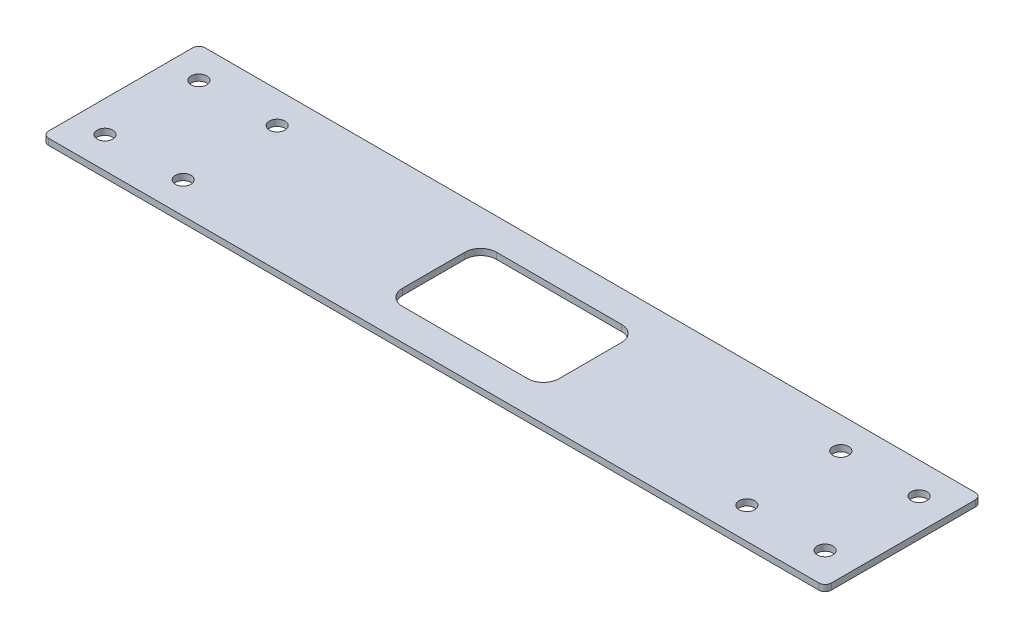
ISO-10303-21;
HEADER;
FILE_DESCRIPTION(('STEP AP214'),'2;1');
FILE_NAME('part.step','',(''),(''),'','','');
FILE_SCHEMA(('AUTOMOTIVE_DESIGN { 1 0 10303 214 1 1 1 1 }'));
ENDSEC;
DATA;
#1=APPLICATION_CONTEXT('core data for automotive mechanical design processes');
#2=APPLICATION_PROTOCOL_DEFINITION('international standard','automotive_design',2000,#1);
#3=PRODUCT_CONTEXT('',#1,'mechanical');
#4=PRODUCT('Part','Part','',(#3));
#5=PRODUCT_RELATED_PRODUCT_CATEGORY('part','',(#4));
#6=PRODUCT_DEFINITION_FORMATION('','',#4);
#7=PRODUCT_DEFINITION_CONTEXT('part definition',#1,'design');
#8=PRODUCT_DEFINITION('design','',#6,#7);
#9=PRODUCT_DEFINITION_SHAPE('','',#8);
#10=(LENGTH_UNIT() NAMED_UNIT(*) SI_UNIT(.MILLI.,.METRE.));
#11=(NAMED_UNIT(*) PLANE_ANGLE_UNIT() SI_UNIT($,.RADIAN.));
#12=(NAMED_UNIT(*) SI_UNIT($,.STERADIAN.) SOLID_ANGLE_UNIT());
#13=UNCERTAINTY_MEASURE_WITH_UNIT(LENGTH_MEASURE(1.E-05),#10,'distance_accuracy_value','');
#14=(GEOMETRIC_REPRESENTATION_CONTEXT(3) GLOBAL_UNCERTAINTY_ASSIGNED_CONTEXT((#13)) GLOBAL_UNIT_ASSIGNED_CONTEXT((#10,
#11,#12)) REPRESENTATION_CONTEXT('',''));
#15=CARTESIAN_POINT('',(0.,0.,0.));
#16=DIRECTION('',(0.,0.,1.));
#17=DIRECTION('',(1.,0.,0.));
#18=AXIS2_PLACEMENT_3D('',#15,#16,#17);
#19=CARTESIAN_POINT('',(-125.,2.,25.));
#20=DIRECTION('',(1.,0.,0.));
#21=DIRECTION('',(0.,0.,-1.));
#22=AXIS2_PLACEMENT_3D('',#19,#20,#21);
#23=PLANE('',#22);
#24=DIRECTION('',(0.,0.,1.));
#25=VECTOR('',#24,1.);
#26=CARTESIAN_POINT('',(-125.,2.,25.));
#27=LINE('',#26,#25);
#28=CARTESIAN_POINT('',(-125.,2.,-23.));
#29=VERTEX_POINT('',#28);
#30=CARTESIAN_POINT('',(-125.,2.,23.));
#31=VERTEX_POINT('',#30);
#32=EDGE_CURVE('E229',#29,#31,#27,.T.);
#33=ORIENTED_EDGE('',*,*,#32,.F.);
#34=DIRECTION('',(0.,-1.,0.));
#35=VECTOR('',#34,1.);
#36=CARTESIAN_POINT('',(-125.,2.,-23.));
#37=LINE('',#36,#35);
#38=CARTESIAN_POINT('',(-125.,0.,-23.));
#39=VERTEX_POINT('',#38);
#40=EDGE_CURVE('E251',#29,#39,#37,.T.);
#41=ORIENTED_EDGE('',*,*,#40,.T.);
#42=DIRECTION('',(0.,0.,1.));
#43=VECTOR('',#42,1.);
#44=CARTESIAN_POINT('',(-125.,0.,25.));
#45=LINE('',#44,#43);
#46=CARTESIAN_POINT('',(-125.,0.,23.));
#47=VERTEX_POINT('',#46);
#48=EDGE_CURVE('E217',#39,#47,#45,.T.);
#49=ORIENTED_EDGE('',*,*,#48,.T.);
#50=DIRECTION('',(0.,-1.,0.));
#51=VECTOR('',#50,1.);
#52=CARTESIAN_POINT('',(-125.,2.,23.));
#53=LINE('',#52,#51);
#54=EDGE_CURVE('E240',#47,#31,#53,.F.);
#55=ORIENTED_EDGE('',*,*,#54,.T.);
#56=EDGE_LOOP('',(#33,#41,#49,#55));
#57=FACE_BOUND('',#56,.T.);
#58=ADVANCED_FACE('F36',(#57),#23,.F.);
#59=CARTESIAN_POINT('',(125.,2.,25.));
#60=DIRECTION('',(0.,0.,-1.));
#61=DIRECTION('',(-1.,0.,0.));
#62=AXIS2_PLACEMENT_3D('',#59,#60,#61);
#63=PLANE('',#62);
#64=DIRECTION('',(1.,0.,0.));
#65=VECTOR('',#64,1.);
#66=CARTESIAN_POINT('',(125.,0.,25.));
#67=LINE('',#66,#65);
#68=CARTESIAN_POINT('',(-123.,0.,25.));
#69=VERTEX_POINT('',#68);
#70=CARTESIAN_POINT('',(123.,0.,25.));
#71=VERTEX_POINT('',#70);
#72=EDGE_CURVE('E243',#69,#71,#67,.T.);
#73=ORIENTED_EDGE('',*,*,#72,.T.);
#74=DIRECTION('',(0.,-1.,0.));
#75=VECTOR('',#74,1.);
#76=CARTESIAN_POINT('',(123.,2.,25.));
#77=LINE('',#76,#75);
#78=CARTESIAN_POINT('',(123.,2.,25.));
#79=VERTEX_POINT('',#78);
#80=EDGE_CURVE('E11',#71,#79,#77,.F.);
#81=ORIENTED_EDGE('',*,*,#80,.T.);
#82=DIRECTION('',(1.,0.,0.));
#83=VECTOR('',#82,1.);
#84=CARTESIAN_POINT('',(125.,2.,25.));
#85=LINE('',#84,#83);
#86=CARTESIAN_POINT('',(-123.,2.,25.));
#87=VERTEX_POINT('',#86);
#88=EDGE_CURVE('E232',#87,#79,#85,.T.);
#89=ORIENTED_EDGE('',*,*,#88,.F.);
#90=DIRECTION('',(0.,-1.,0.));
#91=VECTOR('',#90,1.);
#92=CARTESIAN_POINT('',(-123.,2.,25.));
#93=LINE('',#92,#91);
#94=EDGE_CURVE('E44',#87,#69,#93,.T.);
#95=ORIENTED_EDGE('',*,*,#94,.T.);
#96=EDGE_LOOP('',(#73,#81,#89,#95));
#97=FACE_BOUND('',#96,.T.);
#98=ADVANCED_FACE('F282',(#97),#63,.F.);
#99=CARTESIAN_POINT('',(125.,2.,25.));
#100=DIRECTION('',(-1.,0.,0.));
#101=DIRECTION('',(0.,0.,1.));
#102=AXIS2_PLACEMENT_3D('',#99,#100,#101);
#103=PLANE('',#102);
#104=DIRECTION('',(0.,0.,-1.));
#105=VECTOR('',#104,1.);
#106=CARTESIAN_POINT('',(125.,0.,25.));
#107=LINE('',#106,#105);
#108=CARTESIAN_POINT('',(125.,0.,23.));
#109=VERTEX_POINT('',#108);
#110=CARTESIAN_POINT('',(125.,0.,-23.));
#111=VERTEX_POINT('',#110);
#112=EDGE_CURVE('E246',#109,#111,#107,.T.);
#113=ORIENTED_EDGE('',*,*,#112,.T.);
#114=DIRECTION('',(0.,-1.,0.));
#115=VECTOR('',#114,1.);
#116=CARTESIAN_POINT('',(125.,2.,-23.));
#117=LINE('',#116,#115);
#118=CARTESIAN_POINT('',(125.,2.,-23.));
#119=VERTEX_POINT('',#118);
#120=EDGE_CURVE('E51',#111,#119,#117,.F.);
#121=ORIENTED_EDGE('',*,*,#120,.T.);
#122=DIRECTION('',(0.,0.,-1.));
#123=VECTOR('',#122,1.);
#124=CARTESIAN_POINT('',(125.,2.,25.));
#125=LINE('',#124,#123);
#126=CARTESIAN_POINT('',(125.,2.,23.));
#127=VERTEX_POINT('',#126);
#128=EDGE_CURVE('E235',#127,#119,#125,.T.);
#129=ORIENTED_EDGE('',*,*,#128,.F.);
#130=DIRECTION('',(0.,-1.,0.));
#131=VECTOR('',#130,1.);
#132=CARTESIAN_POINT('',(125.,2.,23.));
#133=LINE('',#132,#131);
#134=EDGE_CURVE('E274',#127,#109,#133,.T.);
#135=ORIENTED_EDGE('',*,*,#134,.T.);
#136=EDGE_LOOP('',(#113,#121,#129,#135));
#137=FACE_BOUND('',#136,.T.);
#138=ADVANCED_FACE('F291',(#137),#103,.F.);
#139=CARTESIAN_POINT('',(125.,2.,-25.));
#140=DIRECTION('',(0.,0.,1.));
#141=DIRECTION('',(1.,0.,0.));
#142=AXIS2_PLACEMENT_3D('',#139,#140,#141);
#143=PLANE('',#142);
#144=DIRECTION('',(-1.,0.,0.));
#145=VECTOR('',#144,1.);
#146=CARTESIAN_POINT('',(125.,0.,-25.));
#147=LINE('',#146,#145);
#148=CARTESIAN_POINT('',(123.,0.,-25.));
#149=VERTEX_POINT('',#148);
#150=CARTESIAN_POINT('',(-123.,0.,-25.));
#151=VERTEX_POINT('',#150);
#152=EDGE_CURVE('E233',#149,#151,#147,.T.);
#153=ORIENTED_EDGE('',*,*,#152,.T.);
#154=DIRECTION('',(0.,-1.,0.));
#155=VECTOR('',#154,1.);
#156=CARTESIAN_POINT('',(-123.,2.,-25.));
#157=LINE('',#156,#155);
#158=CARTESIAN_POINT('',(-123.,2.,-25.));
#159=VERTEX_POINT('',#158);
#160=EDGE_CURVE('E265',#151,#159,#157,.F.);
#161=ORIENTED_EDGE('',*,*,#160,.T.);
#162=DIRECTION('',(-1.,0.,0.));
#163=VECTOR('',#162,1.);
#164=CARTESIAN_POINT('',(125.,2.,-25.));
#165=LINE('',#164,#163);
#166=CARTESIAN_POINT('',(123.,2.,-25.));
#167=VERTEX_POINT('',#166);
#168=EDGE_CURVE('E237',#167,#159,#165,.T.);
#169=ORIENTED_EDGE('',*,*,#168,.F.);
#170=DIRECTION('',(0.,-1.,0.));
#171=VECTOR('',#170,1.);
#172=CARTESIAN_POINT('',(123.,2.,-25.));
#173=LINE('',#172,#171);
#174=EDGE_CURVE('E262',#167,#149,#173,.T.);
#175=ORIENTED_EDGE('',*,*,#174,.T.);
#176=EDGE_LOOP('',(#153,#161,#169,#175));
#177=FACE_BOUND('',#176,.T.);
#178=ADVANCED_FACE('F300',(#177),#143,.F.);
#179=CARTESIAN_POINT('',(0.,2.,0.));
#180=DIRECTION('',(0.,1.,0.));
#181=DIRECTION('',(0.,0.,1.));
#182=AXIS2_PLACEMENT_3D('',#179,#180,#181);
#183=PLANE('',#182);
#184=CARTESIAN_POINT('',(115.,2.,15.));
#185=DIRECTION('',(0.,1.,0.));
#186=DIRECTION('',(0.,0.,1.));
#187=AXIS2_PLACEMENT_3D('',#184,#185,#186);
#188=CIRCLE('',#187,2.5);
#189=CARTESIAN_POINT('',(115.,2.,17.5));
#190=VERTEX_POINT('',#189);
#191=EDGE_CURVE('E571',#190,#190,#188,.T.);
#192=ORIENTED_EDGE('',*,*,#191,.F.);
#193=EDGE_LOOP('',(#192));
#194=FACE_BOUND('',#193,.T.);
#195=CARTESIAN_POINT('',(90.,2.,-15.));
#196=DIRECTION('',(0.,1.,0.));
#197=DIRECTION('',(0.,0.,1.));
#198=AXIS2_PLACEMENT_3D('',#195,#196,#197);
#199=CIRCLE('',#198,2.5);
#200=CARTESIAN_POINT('',(90.,2.,-12.5));
#201=VERTEX_POINT('',#200);
#202=EDGE_CURVE('E573',#201,#201,#199,.T.);
#203=ORIENTED_EDGE('',*,*,#202,.F.);
#204=EDGE_LOOP('',(#203));
#205=FACE_BOUND('',#204,.T.);
#206=CARTESIAN_POINT('',(115.,2.,-15.));
#207=DIRECTION('',(0.,1.,0.));
#208=DIRECTION('',(0.,0.,1.));
#209=AXIS2_PLACEMENT_3D('',#206,#207,#208);
#210=CIRCLE('',#209,2.5);
#211=CARTESIAN_POINT('',(115.,2.,-12.5));
#212=VERTEX_POINT('',#211);
#213=EDGE_CURVE('E581',#212,#212,#210,.T.);
#214=ORIENTED_EDGE('',*,*,#213,.F.);
#215=EDGE_LOOP('',(#214));
#216=FACE_BOUND('',#215,.T.);
#217=CARTESIAN_POINT('',(90.,2.,15.));
#218=DIRECTION('',(0.,1.,0.));
#219=DIRECTION('',(0.,0.,1.));
#220=AXIS2_PLACEMENT_3D('',#217,#218,#219);
#221=CIRCLE('',#220,2.5);
#222=CARTESIAN_POINT('',(90.,2.,17.5));
#223=VERTEX_POINT('',#222);
#224=EDGE_CURVE('E587',#223,#223,#221,.T.);
#225=ORIENTED_EDGE('',*,*,#224,.F.);
#226=EDGE_LOOP('',(#225));
#227=FACE_BOUND('',#226,.T.);
#228=CARTESIAN_POINT('',(-115.,2.,15.));
#229=DIRECTION('',(0.,1.,0.));
#230=DIRECTION('',(0.,0.,1.));
#231=AXIS2_PLACEMENT_3D('',#228,#229,#230);
#232=CIRCLE('',#231,2.5);
#233=CARTESIAN_POINT('',(-115.,2.,17.5));
#234=VERTEX_POINT('',#233);
#235=EDGE_CURVE('E593',#234,#234,#232,.T.);
#236=ORIENTED_EDGE('',*,*,#235,.F.);
#237=EDGE_LOOP('',(#236));
#238=FACE_BOUND('',#237,.T.);
#239=CARTESIAN_POINT('',(-90.,2.,-15.));
#240=DIRECTION('',(0.,1.,0.));
#241=DIRECTION('',(0.,0.,1.));
#242=AXIS2_PLACEMENT_3D('',#239,#240,#241);
#243=CIRCLE('',#242,2.5);
#244=CARTESIAN_POINT('',(-90.,2.,-12.5));
#245=VERTEX_POINT('',#244);
#246=EDGE_CURVE('E599',#245,#245,#243,.T.);
#247=ORIENTED_EDGE('',*,*,#246,.F.);
#248=EDGE_LOOP('',(#247));
#249=FACE_BOUND('',#248,.T.);
#250=CARTESIAN_POINT('',(-115.,2.,-15.));
#251=DIRECTION('',(0.,1.,0.));
#252=DIRECTION('',(0.,0.,1.));
#253=AXIS2_PLACEMENT_3D('',#250,#251,#252);
#254=CIRCLE('',#253,2.5);
#255=CARTESIAN_POINT('',(-115.,2.,-12.5));
#256=VERTEX_POINT('',#255);
#257=EDGE_CURVE('E605',#256,#256,#254,.T.);
#258=ORIENTED_EDGE('',*,*,#257,.F.);
#259=EDGE_LOOP('',(#258));
#260=FACE_BOUND('',#259,.T.);
#261=CARTESIAN_POINT('',(-90.,2.,15.));
#262=DIRECTION('',(0.,1.,0.));
#263=DIRECTION('',(0.,0.,1.));
#264=AXIS2_PLACEMENT_3D('',#261,#262,#263);
#265=CIRCLE('',#264,2.5);
#266=CARTESIAN_POINT('',(-90.,2.,17.5));
#267=VERTEX_POINT('',#266);
#268=EDGE_CURVE('E610',#267,#267,#265,.T.);
#269=ORIENTED_EDGE('',*,*,#268,.F.);
#270=EDGE_LOOP('',(#269));
#271=FACE_BOUND('',#270,.T.);
#272=CARTESIAN_POINT('',(20.,2.,-10.));
#273=DIRECTION('',(0.,1.,0.));
#274=DIRECTION('',(0.,0.,1.));
#275=AXIS2_PLACEMENT_3D('',#272,#273,#274);
#276=CIRCLE('',#275,5.);
#277=CARTESIAN_POINT('',(25.,2.,-9.99999999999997));
#278=VERTEX_POINT('',#277);
#279=CARTESIAN_POINT('',(20.,2.,-15.));
#280=VERTEX_POINT('',#279);
#281=EDGE_CURVE('E157',#278,#280,#276,.T.);
#282=ORIENTED_EDGE('',*,*,#281,.F.);
#283=DIRECTION('',(0.,0.,-1.));
#284=VECTOR('',#283,1.);
#285=CARTESIAN_POINT('',(25.,2.,10.));
#286=LINE('',#285,#284);
#287=CARTESIAN_POINT('',(25.,2.,10.));
#288=VERTEX_POINT('',#287);
#289=EDGE_CURVE('E176',#288,#278,#286,.T.);
#290=ORIENTED_EDGE('',*,*,#289,.F.);
#291=CARTESIAN_POINT('',(20.,2.,10.));
#292=DIRECTION('',(0.,1.,0.));
#293=DIRECTION('',(0.,0.,1.));
#294=AXIS2_PLACEMENT_3D('',#291,#292,#293);
#295=CIRCLE('',#294,5.);
#296=CARTESIAN_POINT('',(20.,2.,15.));
#297=VERTEX_POINT('',#296);
#298=EDGE_CURVE('E179',#297,#288,#295,.T.);
#299=ORIENTED_EDGE('',*,*,#298,.F.);
#300=DIRECTION('',(1.,0.,0.));
#301=VECTOR('',#300,1.);
#302=CARTESIAN_POINT('',(20.,2.,15.));
#303=LINE('',#302,#301);
#304=CARTESIAN_POINT('',(-20.,2.,15.));
#305=VERTEX_POINT('',#304);
#306=EDGE_CURVE('E210',#305,#297,#303,.T.);
#307=ORIENTED_EDGE('',*,*,#306,.F.);
#308=CARTESIAN_POINT('',(-20.,2.,10.));
#309=DIRECTION('',(0.,1.,0.));
#310=DIRECTION('',(0.,0.,-1.));
#311=AXIS2_PLACEMENT_3D('',#308,#309,#310);
#312=CIRCLE('',#311,5.);
#313=CARTESIAN_POINT('',(-25.,2.,10.));
#314=VERTEX_POINT('',#313);
#315=EDGE_CURVE('E207',#314,#305,#312,.T.);
#316=ORIENTED_EDGE('',*,*,#315,.F.);
#317=DIRECTION('',(0.,0.,1.));
#318=VECTOR('',#317,1.);
#319=CARTESIAN_POINT('',(-25.,2.,10.));
#320=LINE('',#319,#318);
#321=CARTESIAN_POINT('',(-25.,2.,-9.99999999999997));
#322=VERTEX_POINT('',#321);
#323=EDGE_CURVE('E204',#322,#314,#320,.T.);
#324=ORIENTED_EDGE('',*,*,#323,.F.);
#325=CARTESIAN_POINT('',(-20.,2.,-10.));
#326=DIRECTION('',(0.,1.,0.));
#327=DIRECTION('',(0.,0.,1.));
#328=AXIS2_PLACEMENT_3D('',#325,#326,#327);
#329=CIRCLE('',#328,5.);
#330=CARTESIAN_POINT('',(-20.,2.,-15.));
#331=VERTEX_POINT('',#330);
#332=EDGE_CURVE('E201',#331,#322,#329,.T.);
#333=ORIENTED_EDGE('',*,*,#332,.F.);
#334=DIRECTION('',(-1.,0.,0.));
#335=VECTOR('',#334,1.);
#336=CARTESIAN_POINT('',(20.,2.,-15.));
#337=LINE('',#336,#335);
#338=EDGE_CURVE('E199',#280,#331,#337,.T.);
#339=ORIENTED_EDGE('',*,*,#338,.F.);
#340=EDGE_LOOP('',(#282,#290,#299,#307,#316,#324,#333,#339));
#341=FACE_BOUND('',#340,.T.);
#342=ORIENTED_EDGE('',*,*,#168,.T.);
#343=CARTESIAN_POINT('',(-123.,2.,-23.));
#344=DIRECTION('',(0.,1.,0.));
#345=DIRECTION('',(0.,0.,1.));
#346=AXIS2_PLACEMENT_3D('',#343,#344,#345);
#347=CIRCLE('',#346,2.);
#348=EDGE_CURVE('E272',#159,#29,#347,.T.);
#349=ORIENTED_EDGE('',*,*,#348,.T.);
#350=ORIENTED_EDGE('',*,*,#32,.T.);
#351=CARTESIAN_POINT('',(-123.,2.,23.));
#352=DIRECTION('',(0.,1.,0.));
#353=DIRECTION('',(0.,0.,1.));
#354=AXIS2_PLACEMENT_3D('',#351,#352,#353);
#355=CIRCLE('',#354,2.);
#356=EDGE_CURVE('E267',#31,#87,#355,.T.);
#357=ORIENTED_EDGE('',*,*,#356,.T.);
#358=ORIENTED_EDGE('',*,*,#88,.T.);
#359=CARTESIAN_POINT('',(123.,2.,23.));
#360=DIRECTION('',(0.,1.,0.));
#361=DIRECTION('',(0.,0.,1.));
#362=AXIS2_PLACEMENT_3D('',#359,#360,#361);
#363=CIRCLE('',#362,2.);
#364=EDGE_CURVE('E58',#79,#127,#363,.T.);
#365=ORIENTED_EDGE('',*,*,#364,.T.);
#366=ORIENTED_EDGE('',*,*,#128,.T.);
#367=CARTESIAN_POINT('',(123.,2.,-23.));
#368=DIRECTION('',(0.,1.,0.));
#369=DIRECTION('',(0.,0.,1.));
#370=AXIS2_PLACEMENT_3D('',#367,#368,#369);
#371=CIRCLE('',#370,2.);
#372=EDGE_CURVE('E270',#119,#167,#371,.T.);
#373=ORIENTED_EDGE('',*,*,#372,.T.);
#374=EDGE_LOOP('',(#342,#349,#350,#357,#358,#365,#366,#373));
#375=FACE_BOUND('',#374,.T.);
#376=ADVANCED_FACE('F293',(#194,#205,#216,#227,#238,#249,#260,#271,#341,#375),#183,.T.);
#377=CARTESIAN_POINT('',(0.,0.,0.));
#378=DIRECTION('',(0.,1.,0.));
#379=DIRECTION('',(0.,0.,1.));
#380=AXIS2_PLACEMENT_3D('',#377,#378,#379);
#381=PLANE('',#380);
#382=CARTESIAN_POINT('',(115.,0.,15.));
#383=DIRECTION('',(0.,1.,0.));
#384=DIRECTION('',(0.,0.,1.));
#385=AXIS2_PLACEMENT_3D('',#382,#383,#384);
#386=CIRCLE('',#385,2.5);
#387=CARTESIAN_POINT('',(115.,0.,17.5));
#388=VERTEX_POINT('',#387);
#389=EDGE_CURVE('E568',#388,#388,#386,.T.);
#390=ORIENTED_EDGE('',*,*,#389,.T.);
#391=EDGE_LOOP('',(#390));
#392=FACE_BOUND('',#391,.T.);
#393=CARTESIAN_POINT('',(90.,0.,-15.));
#394=DIRECTION('',(0.,1.,0.));
#395=DIRECTION('',(0.,0.,1.));
#396=AXIS2_PLACEMENT_3D('',#393,#394,#395);
#397=CIRCLE('',#396,2.5);
#398=CARTESIAN_POINT('',(90.,0.,-12.5));
#399=VERTEX_POINT('',#398);
#400=EDGE_CURVE('E578',#399,#399,#397,.T.);
#401=ORIENTED_EDGE('',*,*,#400,.T.);
#402=EDGE_LOOP('',(#401));
#403=FACE_BOUND('',#402,.T.);
#404=CARTESIAN_POINT('',(115.,0.,-15.));
#405=DIRECTION('',(0.,1.,0.));
#406=DIRECTION('',(0.,0.,1.));
#407=AXIS2_PLACEMENT_3D('',#404,#405,#406);
#408=CIRCLE('',#407,2.5);
#409=CARTESIAN_POINT('',(115.,0.,-12.5));
#410=VERTEX_POINT('',#409);
#411=EDGE_CURVE('E584',#410,#410,#408,.T.);
#412=ORIENTED_EDGE('',*,*,#411,.T.);
#413=EDGE_LOOP('',(#412));
#414=FACE_BOUND('',#413,.T.);
#415=CARTESIAN_POINT('',(90.,0.,15.));
#416=DIRECTION('',(0.,1.,0.));
#417=DIRECTION('',(0.,0.,1.));
#418=AXIS2_PLACEMENT_3D('',#415,#416,#417);
#419=CIRCLE('',#418,2.5);
#420=CARTESIAN_POINT('',(90.,0.,17.5));
#421=VERTEX_POINT('',#420);
#422=EDGE_CURVE('E590',#421,#421,#419,.T.);
#423=ORIENTED_EDGE('',*,*,#422,.T.);
#424=EDGE_LOOP('',(#423));
#425=FACE_BOUND('',#424,.T.);
#426=CARTESIAN_POINT('',(-115.,0.,15.));
#427=DIRECTION('',(0.,1.,0.));
#428=DIRECTION('',(0.,0.,1.));
#429=AXIS2_PLACEMENT_3D('',#426,#427,#428);
#430=CIRCLE('',#429,2.5);
#431=CARTESIAN_POINT('',(-115.,0.,17.5));
#432=VERTEX_POINT('',#431);
#433=EDGE_CURVE('E596',#432,#432,#430,.T.);
#434=ORIENTED_EDGE('',*,*,#433,.T.);
#435=EDGE_LOOP('',(#434));
#436=FACE_BOUND('',#435,.T.);
#437=CARTESIAN_POINT('',(-90.,0.,-15.));
#438=DIRECTION('',(0.,1.,0.));
#439=DIRECTION('',(0.,0.,1.));
#440=AXIS2_PLACEMENT_3D('',#437,#438,#439);
#441=CIRCLE('',#440,2.5);
#442=CARTESIAN_POINT('',(-90.,0.,-12.5));
#443=VERTEX_POINT('',#442);
#444=EDGE_CURVE('E602',#443,#443,#441,.T.);
#445=ORIENTED_EDGE('',*,*,#444,.T.);
#446=EDGE_LOOP('',(#445));
#447=FACE_BOUND('',#446,.T.);
#448=CARTESIAN_POINT('',(-115.,0.,-15.));
#449=DIRECTION('',(0.,1.,0.));
#450=DIRECTION('',(0.,0.,1.));
#451=AXIS2_PLACEMENT_3D('',#448,#449,#450);
#452=CIRCLE('',#451,2.5);
#453=CARTESIAN_POINT('',(-115.,0.,-12.5));
#454=VERTEX_POINT('',#453);
#455=EDGE_CURVE('E608',#454,#454,#452,.T.);
#456=ORIENTED_EDGE('',*,*,#455,.T.);
#457=EDGE_LOOP('',(#456));
#458=FACE_BOUND('',#457,.T.);
#459=CARTESIAN_POINT('',(-90.,0.,15.));
#460=DIRECTION('',(0.,1.,0.));
#461=DIRECTION('',(0.,0.,1.));
#462=AXIS2_PLACEMENT_3D('',#459,#460,#461);
#463=CIRCLE('',#462,2.5);
#464=CARTESIAN_POINT('',(-90.,0.,17.5));
#465=VERTEX_POINT('',#464);
#466=EDGE_CURVE('E182',#465,#465,#463,.T.);
#467=ORIENTED_EDGE('',*,*,#466,.T.);
#468=EDGE_LOOP('',(#467));
#469=FACE_BOUND('',#468,.T.);
#470=DIRECTION('',(0.,0.,-1.));
#471=VECTOR('',#470,1.);
#472=CARTESIAN_POINT('',(25.,0.,10.));
#473=LINE('',#472,#471);
#474=CARTESIAN_POINT('',(25.,0.,10.));
#475=VERTEX_POINT('',#474);
#476=CARTESIAN_POINT('',(25.,0.,-9.99999999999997));
#477=VERTEX_POINT('',#476);
#478=EDGE_CURVE('E162',#475,#477,#473,.T.);
#479=ORIENTED_EDGE('',*,*,#478,.T.);
#480=CARTESIAN_POINT('',(20.,0.,-10.));
#481=DIRECTION('',(0.,1.,0.));
#482=DIRECTION('',(0.,0.,1.));
#483=AXIS2_PLACEMENT_3D('',#480,#481,#482);
#484=CIRCLE('',#483,5.);
#485=CARTESIAN_POINT('',(20.,0.,-15.));
#486=VERTEX_POINT('',#485);
#487=EDGE_CURVE('E154',#477,#486,#484,.T.);
#488=ORIENTED_EDGE('',*,*,#487,.T.);
#489=DIRECTION('',(-1.,0.,0.));
#490=VECTOR('',#489,1.);
#491=CARTESIAN_POINT('',(20.,0.,-15.));
#492=LINE('',#491,#490);
#493=CARTESIAN_POINT('',(-20.,0.,-15.));
#494=VERTEX_POINT('',#493);
#495=EDGE_CURVE('E166',#486,#494,#492,.T.);
#496=ORIENTED_EDGE('',*,*,#495,.T.);
#497=CARTESIAN_POINT('',(-20.,0.,-10.));
#498=DIRECTION('',(0.,1.,0.));
#499=DIRECTION('',(0.,0.,1.));
#500=AXIS2_PLACEMENT_3D('',#497,#498,#499);
#501=CIRCLE('',#500,5.);
#502=CARTESIAN_POINT('',(-25.,0.,-9.99999999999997));
#503=VERTEX_POINT('',#502);
#504=EDGE_CURVE('E170',#494,#503,#501,.T.);
#505=ORIENTED_EDGE('',*,*,#504,.T.);
#506=DIRECTION('',(0.,0.,1.));
#507=VECTOR('',#506,1.);
#508=CARTESIAN_POINT('',(-25.,0.,10.));
#509=LINE('',#508,#507);
#510=CARTESIAN_POINT('',(-25.,0.,10.));
#511=VERTEX_POINT('',#510);
#512=EDGE_CURVE('E186',#503,#511,#509,.T.);
#513=ORIENTED_EDGE('',*,*,#512,.T.);
#514=CARTESIAN_POINT('',(-20.,0.,10.));
#515=DIRECTION('',(0.,1.,0.));
#516=DIRECTION('',(0.,0.,-1.));
#517=AXIS2_PLACEMENT_3D('',#514,#515,#516);
#518=CIRCLE('',#517,5.);
#519=CARTESIAN_POINT('',(-20.,0.,15.));
#520=VERTEX_POINT('',#519);
#521=EDGE_CURVE('E189',#511,#520,#518,.T.);
#522=ORIENTED_EDGE('',*,*,#521,.T.);
#523=DIRECTION('',(1.,0.,0.));
#524=VECTOR('',#523,1.);
#525=CARTESIAN_POINT('',(20.,0.,15.));
#526=LINE('',#525,#524);
#527=CARTESIAN_POINT('',(20.,0.,15.));
#528=VERTEX_POINT('',#527);
#529=EDGE_CURVE('E192',#520,#528,#526,.T.);
#530=ORIENTED_EDGE('',*,*,#529,.T.);
#531=CARTESIAN_POINT('',(20.,0.,10.));
#532=DIRECTION('',(0.,1.,0.));
#533=DIRECTION('',(0.,0.,1.));
#534=AXIS2_PLACEMENT_3D('',#531,#532,#533);
#535=CIRCLE('',#534,5.);
#536=EDGE_CURVE('E195',#528,#475,#535,.T.);
#537=ORIENTED_EDGE('',*,*,#536,.T.);
#538=EDGE_LOOP('',(#479,#488,#496,#505,#513,#522,#530,#537));
#539=FACE_BOUND('',#538,.T.);
#540=ORIENTED_EDGE('',*,*,#48,.F.);
#541=CARTESIAN_POINT('',(-123.,0.,-23.));
#542=DIRECTION('',(0.,1.,0.));
#543=DIRECTION('',(0.,0.,1.));
#544=AXIS2_PLACEMENT_3D('',#541,#542,#543);
#545=CIRCLE('',#544,2.);
#546=EDGE_CURVE('E260',#39,#151,#545,.F.);
#547=ORIENTED_EDGE('',*,*,#546,.T.);
#548=ORIENTED_EDGE('',*,*,#152,.F.);
#549=CARTESIAN_POINT('',(123.,0.,-23.));
#550=DIRECTION('',(0.,1.,0.));
#551=DIRECTION('',(0.,0.,1.));
#552=AXIS2_PLACEMENT_3D('',#549,#550,#551);
#553=CIRCLE('',#552,2.);
#554=EDGE_CURVE('E258',#149,#111,#553,.F.);
#555=ORIENTED_EDGE('',*,*,#554,.T.);
#556=ORIENTED_EDGE('',*,*,#112,.F.);
#557=CARTESIAN_POINT('',(123.,0.,23.));
#558=DIRECTION('',(0.,1.,0.));
#559=DIRECTION('',(0.,0.,1.));
#560=AXIS2_PLACEMENT_3D('',#557,#558,#559);
#561=CIRCLE('',#560,2.);
#562=EDGE_CURVE('E256',#109,#71,#561,.F.);
#563=ORIENTED_EDGE('',*,*,#562,.T.);
#564=ORIENTED_EDGE('',*,*,#72,.F.);
#565=CARTESIAN_POINT('',(-123.,0.,23.));
#566=DIRECTION('',(0.,1.,0.));
#567=DIRECTION('',(0.,0.,1.));
#568=AXIS2_PLACEMENT_3D('',#565,#566,#567);
#569=CIRCLE('',#568,2.);
#570=EDGE_CURVE('E254',#69,#47,#569,.F.);
#571=ORIENTED_EDGE('',*,*,#570,.T.);
#572=EDGE_LOOP('',(#540,#547,#548,#555,#556,#563,#564,#571));
#573=FACE_BOUND('',#572,.T.);
#574=ADVANCED_FACE('F172',(#392,#403,#414,#425,#436,#447,#458,#469,#539,#573),#381,.F.);
#575=CARTESIAN_POINT('',(20.,0.,-10.));
#576=DIRECTION('',(0.,1.,0.));
#577=DIRECTION('',(0.,0.,1.));
#578=AXIS2_PLACEMENT_3D('',#575,#576,#577);
#579=CYLINDRICAL_SURFACE('',#578,5.);
#580=ORIENTED_EDGE('',*,*,#281,.T.);
#581=DIRECTION('',(0.,1.,0.));
#582=VECTOR('',#581,1.);
#583=CARTESIAN_POINT('',(20.,0.,-15.));
#584=LINE('',#583,#582);
#585=EDGE_CURVE('E150',#486,#280,#584,.T.);
#586=ORIENTED_EDGE('',*,*,#585,.F.);
#587=ORIENTED_EDGE('',*,*,#487,.F.);
#588=DIRECTION('',(0.,1.,0.));
#589=VECTOR('',#588,1.);
#590=CARTESIAN_POINT('',(25.,0.,-9.99999999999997));
#591=LINE('',#590,#589);
#592=EDGE_CURVE('E215',#477,#278,#591,.T.);
#593=ORIENTED_EDGE('',*,*,#592,.T.);
#594=EDGE_LOOP('',(#580,#586,#587,#593));
#595=FACE_BOUND('',#594,.T.);
#596=ADVANCED_FACE('F152',(#595),#579,.F.);
#597=CARTESIAN_POINT('',(25.,0.,10.));
#598=DIRECTION('',(1.,0.,0.));
#599=DIRECTION('',(0.,0.,-1.));
#600=AXIS2_PLACEMENT_3D('',#597,#598,#599);
#601=PLANE('',#600);
#602=ORIENTED_EDGE('',*,*,#289,.T.);
#603=ORIENTED_EDGE('',*,*,#592,.F.);
#604=ORIENTED_EDGE('',*,*,#478,.F.);
#605=DIRECTION('',(0.,1.,0.));
#606=VECTOR('',#605,1.);
#607=CARTESIAN_POINT('',(25.,0.,10.));
#608=LINE('',#607,#606);
#609=EDGE_CURVE('E218',#475,#288,#608,.T.);
#610=ORIENTED_EDGE('',*,*,#609,.T.);
#611=EDGE_LOOP('',(#602,#603,#604,#610));
#612=FACE_BOUND('',#611,.T.);
#613=ADVANCED_FACE('F412',(#612),#601,.F.);
#614=CARTESIAN_POINT('',(20.,0.,10.));
#615=DIRECTION('',(0.,1.,0.));
#616=DIRECTION('',(0.,0.,1.));
#617=AXIS2_PLACEMENT_3D('',#614,#615,#616);
#618=CYLINDRICAL_SURFACE('',#617,5.);
#619=ORIENTED_EDGE('',*,*,#298,.T.);
#620=ORIENTED_EDGE('',*,*,#609,.F.);
#621=ORIENTED_EDGE('',*,*,#536,.F.);
#622=DIRECTION('',(0.,1.,0.));
#623=VECTOR('',#622,1.);
#624=CARTESIAN_POINT('',(20.,0.,15.));
#625=LINE('',#624,#623);
#626=EDGE_CURVE('E220',#528,#297,#625,.T.);
#627=ORIENTED_EDGE('',*,*,#626,.T.);
#628=EDGE_LOOP('',(#619,#620,#621,#627));
#629=FACE_BOUND('',#628,.T.);
#630=ADVANCED_FACE('F402',(#629),#618,.F.);
#631=CARTESIAN_POINT('',(20.,0.,15.));
#632=DIRECTION('',(0.,0.,1.));
#633=DIRECTION('',(1.,0.,0.));
#634=AXIS2_PLACEMENT_3D('',#631,#632,#633);
#635=PLANE('',#634);
#636=ORIENTED_EDGE('',*,*,#306,.T.);
#637=ORIENTED_EDGE('',*,*,#626,.F.);
#638=ORIENTED_EDGE('',*,*,#529,.F.);
#639=DIRECTION('',(0.,1.,0.));
#640=VECTOR('',#639,1.);
#641=CARTESIAN_POINT('',(-20.,0.,15.));
#642=LINE('',#641,#640);
#643=EDGE_CURVE('E222',#520,#305,#642,.T.);
#644=ORIENTED_EDGE('',*,*,#643,.T.);
#645=EDGE_LOOP('',(#636,#637,#638,#644));
#646=FACE_BOUND('',#645,.T.);
#647=ADVANCED_FACE('F392',(#646),#635,.F.);
#648=CARTESIAN_POINT('',(-20.,0.,10.));
#649=DIRECTION('',(0.,1.,0.));
#650=DIRECTION('',(0.,0.,1.));
#651=AXIS2_PLACEMENT_3D('',#648,#649,#650);
#652=CYLINDRICAL_SURFACE('',#651,5.);
#653=ORIENTED_EDGE('',*,*,#315,.T.);
#654=ORIENTED_EDGE('',*,*,#643,.F.);
#655=ORIENTED_EDGE('',*,*,#521,.F.);
#656=DIRECTION('',(0.,1.,0.));
#657=VECTOR('',#656,1.);
#658=CARTESIAN_POINT('',(-25.,0.,10.));
#659=LINE('',#658,#657);
#660=EDGE_CURVE('E224',#511,#314,#659,.T.);
#661=ORIENTED_EDGE('',*,*,#660,.T.);
#662=EDGE_LOOP('',(#653,#654,#655,#661));
#663=FACE_BOUND('',#662,.T.);
#664=ADVANCED_FACE('F382',(#663),#652,.F.);
#665=CARTESIAN_POINT('',(-25.,0.,10.));
#666=DIRECTION('',(-1.,0.,0.));
#667=DIRECTION('',(0.,0.,1.));
#668=AXIS2_PLACEMENT_3D('',#665,#666,#667);
#669=PLANE('',#668);
#670=ORIENTED_EDGE('',*,*,#323,.T.);
#671=ORIENTED_EDGE('',*,*,#660,.F.);
#672=ORIENTED_EDGE('',*,*,#512,.F.);
#673=DIRECTION('',(0.,1.,0.));
#674=VECTOR('',#673,1.);
#675=CARTESIAN_POINT('',(-25.,0.,-9.99999999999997));
#676=LINE('',#675,#674);
#677=EDGE_CURVE('E226',#503,#322,#676,.T.);
#678=ORIENTED_EDGE('',*,*,#677,.T.);
#679=EDGE_LOOP('',(#670,#671,#672,#678));
#680=FACE_BOUND('',#679,.T.);
#681=ADVANCED_FACE('F372',(#680),#669,.F.);
#682=CARTESIAN_POINT('',(-20.,0.,-10.));
#683=DIRECTION('',(0.,1.,0.));
#684=DIRECTION('',(0.,0.,1.));
#685=AXIS2_PLACEMENT_3D('',#682,#683,#684);
#686=CYLINDRICAL_SURFACE('',#685,5.);
#687=ORIENTED_EDGE('',*,*,#332,.T.);
#688=ORIENTED_EDGE('',*,*,#677,.F.);
#689=ORIENTED_EDGE('',*,*,#504,.F.);
#690=DIRECTION('',(0.,1.,0.));
#691=VECTOR('',#690,1.);
#692=CARTESIAN_POINT('',(-20.,0.,-15.));
#693=LINE('',#692,#691);
#694=EDGE_CURVE('E161',#494,#331,#693,.T.);
#695=ORIENTED_EDGE('',*,*,#694,.T.);
#696=EDGE_LOOP('',(#687,#688,#689,#695));
#697=FACE_BOUND('',#696,.T.);
#698=ADVANCED_FACE('F362',(#697),#686,.F.);
#699=CARTESIAN_POINT('',(20.,0.,-15.));
#700=DIRECTION('',(0.,0.,-1.));
#701=DIRECTION('',(-1.,0.,0.));
#702=AXIS2_PLACEMENT_3D('',#699,#700,#701);
#703=PLANE('',#702);
#704=ORIENTED_EDGE('',*,*,#338,.T.);
#705=ORIENTED_EDGE('',*,*,#694,.F.);
#706=ORIENTED_EDGE('',*,*,#495,.F.);
#707=ORIENTED_EDGE('',*,*,#585,.T.);
#708=EDGE_LOOP('',(#704,#705,#706,#707));
#709=FACE_BOUND('',#708,.T.);
#710=ADVANCED_FACE('F167',(#709),#703,.F.);
#711=CARTESIAN_POINT('',(-90.,2.,15.));
#712=DIRECTION('',(0.,1.,0.));
#713=DIRECTION('',(0.,0.,1.));
#714=AXIS2_PLACEMENT_3D('',#711,#712,#713);
#715=CYLINDRICAL_SURFACE('',#714,2.5);
#716=ORIENTED_EDGE('',*,*,#466,.F.);
#717=EDGE_LOOP('',(#716));
#718=FACE_BOUND('',#717,.T.);
#719=ORIENTED_EDGE('',*,*,#268,.T.);
#720=EDGE_LOOP('',(#719));
#721=FACE_BOUND('',#720,.T.);
#722=ADVANCED_FACE('F361',(#718,#721),#715,.F.);
#723=CARTESIAN_POINT('',(-115.,2.,-15.));
#724=DIRECTION('',(0.,1.,0.));
#725=DIRECTION('',(0.,0.,1.));
#726=AXIS2_PLACEMENT_3D('',#723,#724,#725);
#727=CYLINDRICAL_SURFACE('',#726,2.5);
#728=ORIENTED_EDGE('',*,*,#455,.F.);
#729=EDGE_LOOP('',(#728));
#730=FACE_BOUND('',#729,.T.);
#731=ORIENTED_EDGE('',*,*,#257,.T.);
#732=EDGE_LOOP('',(#731));
#733=FACE_BOUND('',#732,.T.);
#734=ADVANCED_FACE('F513',(#730,#733),#727,.F.);
#735=CARTESIAN_POINT('',(-90.,2.,-15.));
#736=DIRECTION('',(0.,1.,0.));
#737=DIRECTION('',(0.,0.,1.));
#738=AXIS2_PLACEMENT_3D('',#735,#736,#737);
#739=CYLINDRICAL_SURFACE('',#738,2.5);
#740=ORIENTED_EDGE('',*,*,#444,.F.);
#741=EDGE_LOOP('',(#740));
#742=FACE_BOUND('',#741,.T.);
#743=ORIENTED_EDGE('',*,*,#246,.T.);
#744=EDGE_LOOP('',(#743));
#745=FACE_BOUND('',#744,.T.);
#746=ADVANCED_FACE('F520',(#742,#745),#739,.F.);
#747=CARTESIAN_POINT('',(-115.,2.,15.));
#748=DIRECTION('',(0.,1.,0.));
#749=DIRECTION('',(0.,0.,1.));
#750=AXIS2_PLACEMENT_3D('',#747,#748,#749);
#751=CYLINDRICAL_SURFACE('',#750,2.5);
#752=ORIENTED_EDGE('',*,*,#433,.F.);
#753=EDGE_LOOP('',(#752));
#754=FACE_BOUND('',#753,.T.);
#755=ORIENTED_EDGE('',*,*,#235,.T.);
#756=EDGE_LOOP('',(#755));
#757=FACE_BOUND('',#756,.T.);
#758=ADVANCED_FACE('F528',(#754,#757),#751,.F.);
#759=CARTESIAN_POINT('',(90.,2.,15.));
#760=DIRECTION('',(0.,1.,0.));
#761=DIRECTION('',(0.,0.,1.));
#762=AXIS2_PLACEMENT_3D('',#759,#760,#761);
#763=CYLINDRICAL_SURFACE('',#762,2.5);
#764=ORIENTED_EDGE('',*,*,#422,.F.);
#765=EDGE_LOOP('',(#764));
#766=FACE_BOUND('',#765,.T.);
#767=ORIENTED_EDGE('',*,*,#224,.T.);
#768=EDGE_LOOP('',(#767));
#769=FACE_BOUND('',#768,.T.);
#770=ADVANCED_FACE('F536',(#766,#769),#763,.F.);
#771=CARTESIAN_POINT('',(115.,2.,-15.));
#772=DIRECTION('',(0.,1.,0.));
#773=DIRECTION('',(0.,0.,1.));
#774=AXIS2_PLACEMENT_3D('',#771,#772,#773);
#775=CYLINDRICAL_SURFACE('',#774,2.5);
#776=ORIENTED_EDGE('',*,*,#411,.F.);
#777=EDGE_LOOP('',(#776));
#778=FACE_BOUND('',#777,.T.);
#779=ORIENTED_EDGE('',*,*,#213,.T.);
#780=EDGE_LOOP('',(#779));
#781=FACE_BOUND('',#780,.T.);
#782=ADVANCED_FACE('F544',(#778,#781),#775,.F.);
#783=CARTESIAN_POINT('',(90.,2.,-15.));
#784=DIRECTION('',(0.,1.,0.));
#785=DIRECTION('',(0.,0.,1.));
#786=AXIS2_PLACEMENT_3D('',#783,#784,#785);
#787=CYLINDRICAL_SURFACE('',#786,2.5);
#788=ORIENTED_EDGE('',*,*,#400,.F.);
#789=EDGE_LOOP('',(#788));
#790=FACE_BOUND('',#789,.T.);
#791=ORIENTED_EDGE('',*,*,#202,.T.);
#792=EDGE_LOOP('',(#791));
#793=FACE_BOUND('',#792,.T.);
#794=ADVANCED_FACE('F552',(#790,#793),#787,.F.);
#795=CARTESIAN_POINT('',(115.,2.,15.));
#796=DIRECTION('',(0.,1.,0.));
#797=DIRECTION('',(0.,0.,1.));
#798=AXIS2_PLACEMENT_3D('',#795,#796,#797);
#799=CYLINDRICAL_SURFACE('',#798,2.5);
#800=ORIENTED_EDGE('',*,*,#389,.F.);
#801=EDGE_LOOP('',(#800));
#802=FACE_BOUND('',#801,.T.);
#803=ORIENTED_EDGE('',*,*,#191,.T.);
#804=EDGE_LOOP('',(#803));
#805=FACE_BOUND('',#804,.T.);
#806=ADVANCED_FACE('F323',(#802,#805),#799,.F.);
#807=CARTESIAN_POINT('',(-123.,2.,-23.));
#808=DIRECTION('',(0.,-1.,0.));
#809=DIRECTION('',(0.,0.,-1.));
#810=AXIS2_PLACEMENT_3D('',#807,#808,#809);
#811=CYLINDRICAL_SURFACE('',#810,2.);
#812=ORIENTED_EDGE('',*,*,#348,.F.);
#813=ORIENTED_EDGE('',*,*,#160,.F.);
#814=ORIENTED_EDGE('',*,*,#546,.F.);
#815=ORIENTED_EDGE('',*,*,#40,.F.);
#816=EDGE_LOOP('',(#812,#813,#814,#815));
#817=FACE_BOUND('',#816,.T.);
#818=ADVANCED_FACE('F305',(#817),#811,.T.);
#819=CARTESIAN_POINT('',(123.,2.,-23.));
#820=DIRECTION('',(0.,-1.,0.));
#821=DIRECTION('',(0.,0.,-1.));
#822=AXIS2_PLACEMENT_3D('',#819,#820,#821);
#823=CYLINDRICAL_SURFACE('',#822,2.);
#824=ORIENTED_EDGE('',*,*,#372,.F.);
#825=ORIENTED_EDGE('',*,*,#120,.F.);
#826=ORIENTED_EDGE('',*,*,#554,.F.);
#827=ORIENTED_EDGE('',*,*,#174,.F.);
#828=EDGE_LOOP('',(#824,#825,#826,#827));
#829=FACE_BOUND('',#828,.T.);
#830=ADVANCED_FACE('F297',(#829),#823,.T.);
#831=CARTESIAN_POINT('',(123.,2.,23.));
#832=DIRECTION('',(0.,-1.,0.));
#833=DIRECTION('',(0.,0.,-1.));
#834=AXIS2_PLACEMENT_3D('',#831,#832,#833);
#835=CYLINDRICAL_SURFACE('',#834,2.);
#836=ORIENTED_EDGE('',*,*,#364,.F.);
#837=ORIENTED_EDGE('',*,*,#80,.F.);
#838=ORIENTED_EDGE('',*,*,#562,.F.);
#839=ORIENTED_EDGE('',*,*,#134,.F.);
#840=EDGE_LOOP('',(#836,#837,#838,#839));
#841=FACE_BOUND('',#840,.T.);
#842=ADVANCED_FACE('F290',(#841),#835,.T.);
#843=CARTESIAN_POINT('',(-123.,2.,23.));
#844=DIRECTION('',(0.,-1.,0.));
#845=DIRECTION('',(0.,0.,-1.));
#846=AXIS2_PLACEMENT_3D('',#843,#844,#845);
#847=CYLINDRICAL_SURFACE('',#846,2.);
#848=ORIENTED_EDGE('',*,*,#356,.F.);
#849=ORIENTED_EDGE('',*,*,#54,.F.);
#850=ORIENTED_EDGE('',*,*,#570,.F.);
#851=ORIENTED_EDGE('',*,*,#94,.F.);
#852=EDGE_LOOP('',(#848,#849,#850,#851));
#853=FACE_BOUND('',#852,.T.);
#854=ADVANCED_FACE('F38',(#853),#847,.T.);
#855=CLOSED_SHELL('',(#58,#98,#138,#178,#376,#574,#596,#613,#630,#647,#664,#681,#698,#710,#722,
#734,#746,#758,#770,#782,#794,#806,#818,#830,#842,#854));
#856=MANIFOLD_SOLID_BREP('B2',#855);
#857=ADVANCED_BREP_SHAPE_REPRESENTATION('',(#18,#856),#14);
#858=SHAPE_DEFINITION_REPRESENTATION(#9,#857);
ENDSEC;
END-ISO-10303-21;
